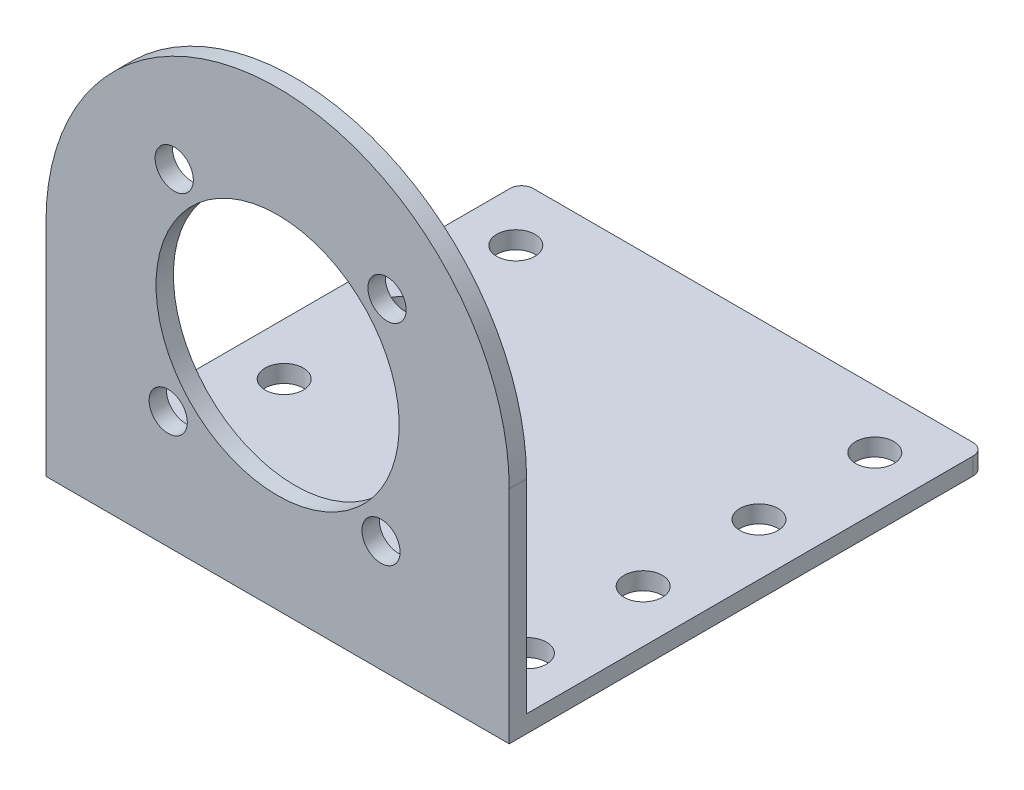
ISO-10303-21;
HEADER;
FILE_DESCRIPTION(('STEP AP214'),'2;1');
FILE_NAME('part.step','',(''),(''),'','','');
FILE_SCHEMA(('AUTOMOTIVE_DESIGN { 1 0 10303 214 1 1 1 1 }'));
ENDSEC;
DATA;
#1=APPLICATION_CONTEXT('core data for automotive mechanical design processes');
#2=APPLICATION_PROTOCOL_DEFINITION('international standard','automotive_design',2000,#1);
#3=PRODUCT_CONTEXT('',#1,'mechanical');
#4=PRODUCT('Part','Part','',(#3));
#5=PRODUCT_RELATED_PRODUCT_CATEGORY('part','',(#4));
#6=PRODUCT_DEFINITION_FORMATION('','',#4);
#7=PRODUCT_DEFINITION_CONTEXT('part definition',#1,'design');
#8=PRODUCT_DEFINITION('design','',#6,#7);
#9=PRODUCT_DEFINITION_SHAPE('','',#8);
#10=(LENGTH_UNIT() NAMED_UNIT(*) SI_UNIT(.MILLI.,.METRE.));
#11=(NAMED_UNIT(*) PLANE_ANGLE_UNIT() SI_UNIT($,.RADIAN.));
#12=(NAMED_UNIT(*) SI_UNIT($,.STERADIAN.) SOLID_ANGLE_UNIT());
#13=UNCERTAINTY_MEASURE_WITH_UNIT(LENGTH_MEASURE(1.E-05),#10,'distance_accuracy_value','');
#14=(GEOMETRIC_REPRESENTATION_CONTEXT(3) GLOBAL_UNCERTAINTY_ASSIGNED_CONTEXT((#13)) GLOBAL_UNIT_ASSIGNED_CONTEXT((#10,
#11,#12)) REPRESENTATION_CONTEXT('',''));
#15=CARTESIAN_POINT('',(0.,0.,0.));
#16=DIRECTION('',(0.,0.,1.));
#17=DIRECTION('',(1.,0.,0.));
#18=AXIS2_PLACEMENT_3D('',#15,#16,#17);
#19=CARTESIAN_POINT('',(40.,36.5355172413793,36.8894084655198));
#20=DIRECTION('',(0.,0.,-1.));
#21=DIRECTION('',(0.,1.,0.));
#22=AXIS2_PLACEMENT_3D('',#19,#20,#21);
#23=PLANE('',#22);
#24=CARTESIAN_POINT('',(29.4484356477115,25.4645185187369,36.8894084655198));
#25=DIRECTION('',(0.,0.,-1.));
#26=DIRECTION('',(0.,1.,0.));
#27=AXIS2_PLACEMENT_3D('',#24,#25,#26);
#28=CIRCLE('',#27,1.65000000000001);
#29=CARTESIAN_POINT('',(29.4484356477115,27.1145185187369,36.8894084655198));
#30=VERTEX_POINT('',#29);
#31=EDGE_CURVE('E642',#30,#30,#28,.T.);
#32=ORIENTED_EDGE('',*,*,#31,.T.);
#33=EDGE_LOOP('',(#32));
#34=FACE_BOUND('',#33,.T.);
#35=CARTESIAN_POINT('',(11.0709987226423,25.9839528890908,36.8894084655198));
#36=DIRECTION('',(0.,0.,-1.));
#37=DIRECTION('',(0.,1.,0.));
#38=AXIS2_PLACEMENT_3D('',#35,#36,#37);
#39=CIRCLE('',#38,1.65);
#40=CARTESIAN_POINT('',(11.0709987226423,27.6339528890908,36.8894084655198));
#41=VERTEX_POINT('',#40);
#42=EDGE_CURVE('E226',#41,#41,#39,.T.);
#43=ORIENTED_EDGE('',*,*,#42,.T.);
#44=EDGE_LOOP('',(#43));
#45=FACE_BOUND('',#44,.T.);
#46=CARTESIAN_POINT('',(10.5515643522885,7.6065159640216,36.8894084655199));
#47=DIRECTION('',(0.,0.,-1.));
#48=DIRECTION('',(0.,1.,0.));
#49=AXIS2_PLACEMENT_3D('',#46,#47,#48);
#50=CIRCLE('',#49,1.64999999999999);
#51=CARTESIAN_POINT('',(10.5515643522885,9.25651596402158,36.8894084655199));
#52=VERTEX_POINT('',#51);
#53=EDGE_CURVE('E298',#52,#52,#50,.T.);
#54=ORIENTED_EDGE('',*,*,#53,.T.);
#55=EDGE_LOOP('',(#54));
#56=FACE_BOUND('',#55,.T.);
#57=CARTESIAN_POINT('',(28.9290012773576,7.08708159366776,36.8894084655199));
#58=DIRECTION('',(0.,0.,-1.));
#59=DIRECTION('',(0.,1.,0.));
#60=AXIS2_PLACEMENT_3D('',#57,#58,#59);
#61=CIRCLE('',#60,1.64999999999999);
#62=CARTESIAN_POINT('',(28.9290012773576,8.73708159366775,36.8894084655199));
#63=VERTEX_POINT('',#62);
#64=EDGE_CURVE('E307',#63,#63,#61,.T.);
#65=ORIENTED_EDGE('',*,*,#64,.T.);
#66=EDGE_LOOP('',(#65));
#67=FACE_BOUND('',#66,.T.);
#68=CARTESIAN_POINT('',(20.,16.5355172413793,36.8894084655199));
#69=DIRECTION('',(0.,0.,-1.));
#70=DIRECTION('',(0.,1.,0.));
#71=AXIS2_PLACEMENT_3D('',#68,#69,#70);
#72=CIRCLE('',#71,10.5);
#73=CARTESIAN_POINT('',(20.,27.0355172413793,36.8894084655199));
#74=VERTEX_POINT('',#73);
#75=EDGE_CURVE('E313',#74,#74,#72,.T.);
#76=ORIENTED_EDGE('',*,*,#75,.T.);
#77=EDGE_LOOP('',(#76));
#78=FACE_BOUND('',#77,.T.);
#79=CARTESIAN_POINT('',(20.,16.5355172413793,36.8894084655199));
#80=DIRECTION('',(0.,0.,-1.));
#81=DIRECTION('',(0.,1.,0.));
#82=AXIS2_PLACEMENT_3D('',#79,#80,#81);
#83=CIRCLE('',#82,20.);
#84=CARTESIAN_POINT('',(40.,16.5355172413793,36.8894084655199));
#85=VERTEX_POINT('',#84);
#86=CARTESIAN_POINT('',(0.,16.5355172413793,36.8894084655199));
#87=VERTEX_POINT('',#86);
#88=EDGE_CURVE('E225',#85,#87,#83,.F.);
#89=ORIENTED_EDGE('',*,*,#88,.T.);
#90=DIRECTION('',(0.,-1.,0.));
#91=VECTOR('',#90,1.);
#92=CARTESIAN_POINT('',(0.,36.5355172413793,36.8894084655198));
#93=LINE('',#92,#91);
#94=CARTESIAN_POINT('',(0.,-2.53448275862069,36.8894084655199));
#95=VERTEX_POINT('',#94);
#96=EDGE_CURVE('E231',#87,#95,#93,.T.);
#97=ORIENTED_EDGE('',*,*,#96,.T.);
#98=DIRECTION('',(-1.,0.,0.));
#99=VECTOR('',#98,1.);
#100=CARTESIAN_POINT('',(40.,-2.53448275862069,36.8894084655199));
#101=LINE('',#100,#99);
#102=CARTESIAN_POINT('',(40.,-2.53448275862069,36.8894084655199));
#103=VERTEX_POINT('',#102);
#104=EDGE_CURVE('E246',#103,#95,#101,.T.);
#105=ORIENTED_EDGE('',*,*,#104,.F.);
#106=DIRECTION('',(0.,-1.,0.));
#107=VECTOR('',#106,1.);
#108=CARTESIAN_POINT('',(40.,36.5355172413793,36.8894084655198));
#109=LINE('',#108,#107);
#110=EDGE_CURVE('E238',#85,#103,#109,.T.);
#111=ORIENTED_EDGE('',*,*,#110,.F.);
#112=EDGE_LOOP('',(#89,#97,#105,#111));
#113=FACE_BOUND('',#112,.T.);
#114=ADVANCED_FACE('F146',(#34,#45,#56,#67,#78,#113),#23,.F.);
#115=CARTESIAN_POINT('',(40.,36.5355172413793,35.3894084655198));
#116=DIRECTION('',(0.,0.,-1.));
#117=DIRECTION('',(0.,1.,0.));
#118=AXIS2_PLACEMENT_3D('',#115,#116,#117);
#119=PLANE('',#118);
#120=CARTESIAN_POINT('',(29.4484356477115,25.4645185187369,35.3894084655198));
#121=DIRECTION('',(0.,0.,-1.));
#122=DIRECTION('',(0.,1.,0.));
#123=AXIS2_PLACEMENT_3D('',#120,#121,#122);
#124=CIRCLE('',#123,1.65000000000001);
#125=CARTESIAN_POINT('',(29.4484356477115,27.1145185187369,35.3894084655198));
#126=VERTEX_POINT('',#125);
#127=EDGE_CURVE('E640',#126,#126,#124,.T.);
#128=ORIENTED_EDGE('',*,*,#127,.F.);
#129=EDGE_LOOP('',(#128));
#130=FACE_BOUND('',#129,.T.);
#131=CARTESIAN_POINT('',(11.0709987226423,25.9839528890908,35.3894084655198));
#132=DIRECTION('',(0.,0.,-1.));
#133=DIRECTION('',(0.,1.,0.));
#134=AXIS2_PLACEMENT_3D('',#131,#132,#133);
#135=CIRCLE('',#134,1.65);
#136=CARTESIAN_POINT('',(11.0709987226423,27.6339528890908,35.3894084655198));
#137=VERTEX_POINT('',#136);
#138=EDGE_CURVE('E643',#137,#137,#135,.T.);
#139=ORIENTED_EDGE('',*,*,#138,.F.);
#140=EDGE_LOOP('',(#139));
#141=FACE_BOUND('',#140,.T.);
#142=CARTESIAN_POINT('',(10.5515643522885,7.6065159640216,35.3894084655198));
#143=DIRECTION('',(0.,0.,-1.));
#144=DIRECTION('',(0.,1.,0.));
#145=AXIS2_PLACEMENT_3D('',#142,#143,#144);
#146=CIRCLE('',#145,1.64999999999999);
#147=CARTESIAN_POINT('',(10.5515643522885,9.25651596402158,35.3894084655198));
#148=VERTEX_POINT('',#147);
#149=EDGE_CURVE('E295',#148,#148,#146,.T.);
#150=ORIENTED_EDGE('',*,*,#149,.F.);
#151=EDGE_LOOP('',(#150));
#152=FACE_BOUND('',#151,.T.);
#153=CARTESIAN_POINT('',(28.9290012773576,7.08708159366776,35.3894084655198));
#154=DIRECTION('',(0.,0.,-1.));
#155=DIRECTION('',(0.,1.,0.));
#156=AXIS2_PLACEMENT_3D('',#153,#154,#155);
#157=CIRCLE('',#156,1.64999999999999);
#158=CARTESIAN_POINT('',(28.9290012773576,8.73708159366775,35.3894084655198));
#159=VERTEX_POINT('',#158);
#160=EDGE_CURVE('E304',#159,#159,#157,.T.);
#161=ORIENTED_EDGE('',*,*,#160,.F.);
#162=EDGE_LOOP('',(#161));
#163=FACE_BOUND('',#162,.T.);
#164=CARTESIAN_POINT('',(20.,16.5355172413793,35.3894084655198));
#165=DIRECTION('',(0.,0.,-1.));
#166=DIRECTION('',(0.,1.,0.));
#167=AXIS2_PLACEMENT_3D('',#164,#165,#166);
#168=CIRCLE('',#167,10.5);
#169=CARTESIAN_POINT('',(20.,27.0355172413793,35.3894084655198));
#170=VERTEX_POINT('',#169);
#171=EDGE_CURVE('E310',#170,#170,#168,.T.);
#172=ORIENTED_EDGE('',*,*,#171,.F.);
#173=EDGE_LOOP('',(#172));
#174=FACE_BOUND('',#173,.T.);
#175=DIRECTION('',(0.,-1.,0.));
#176=VECTOR('',#175,1.);
#177=CARTESIAN_POINT('',(0.,36.5355172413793,35.3894084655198));
#178=LINE('',#177,#176);
#179=CARTESIAN_POINT('',(0.,16.5355172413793,35.3894084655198));
#180=VERTEX_POINT('',#179);
#181=CARTESIAN_POINT('',(0.,-1.03448275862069,35.3894084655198));
#182=VERTEX_POINT('',#181);
#183=EDGE_CURVE('E229',#180,#182,#178,.T.);
#184=ORIENTED_EDGE('',*,*,#183,.F.);
#185=CARTESIAN_POINT('',(20.,16.5355172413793,35.3894084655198));
#186=DIRECTION('',(0.,0.,-1.));
#187=DIRECTION('',(0.,1.,0.));
#188=AXIS2_PLACEMENT_3D('',#185,#186,#187);
#189=CIRCLE('',#188,20.);
#190=CARTESIAN_POINT('',(40.,16.5355172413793,35.3894084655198));
#191=VERTEX_POINT('',#190);
#192=EDGE_CURVE('E215',#191,#180,#189,.F.);
#193=ORIENTED_EDGE('',*,*,#192,.F.);
#194=DIRECTION('',(0.,-1.,0.));
#195=VECTOR('',#194,1.);
#196=CARTESIAN_POINT('',(40.,36.5355172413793,35.3894084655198));
#197=LINE('',#196,#195);
#198=CARTESIAN_POINT('',(40.,-1.03448275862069,35.3894084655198));
#199=VERTEX_POINT('',#198);
#200=EDGE_CURVE('E249',#191,#199,#197,.T.);
#201=ORIENTED_EDGE('',*,*,#200,.T.);
#202=DIRECTION('',(1.,0.,0.));
#203=VECTOR('',#202,1.);
#204=CARTESIAN_POINT('',(40.,-1.03448275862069,35.3894084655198));
#205=LINE('',#204,#203);
#206=EDGE_CURVE('E236',#182,#199,#205,.T.);
#207=ORIENTED_EDGE('',*,*,#206,.F.);
#208=EDGE_LOOP('',(#184,#193,#201,#207));
#209=FACE_BOUND('',#208,.T.);
#210=ADVANCED_FACE('F234',(#130,#141,#152,#163,#174,#209),#119,.T.);
#211=CARTESIAN_POINT('',(0.,0.,0.));
#212=DIRECTION('',(1.,0.,0.));
#213=DIRECTION('',(0.,0.,-1.));
#214=AXIS2_PLACEMENT_3D('',#211,#212,#213);
#215=PLANE('',#214);
#216=DIRECTION('',(0.,0.,-1.));
#217=VECTOR('',#216,1.);
#218=CARTESIAN_POINT('',(0.,-1.03448275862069,36.8894084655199));
#219=LINE('',#218,#217);
#220=CARTESIAN_POINT('',(0.,-1.03448275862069,-3.17959153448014));
#221=VERTEX_POINT('',#220);
#222=EDGE_CURVE('E254',#182,#221,#219,.T.);
#223=ORIENTED_EDGE('',*,*,#222,.T.);
#224=DIRECTION('',(0.,1.,0.));
#225=VECTOR('',#224,1.);
#226=CARTESIAN_POINT('',(0.,0.,-3.17959153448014));
#227=LINE('',#226,#225);
#228=CARTESIAN_POINT('',(0.,-2.53448275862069,-3.17959153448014));
#229=VERTEX_POINT('',#228);
#230=EDGE_CURVE('E169',#221,#229,#227,.F.);
#231=ORIENTED_EDGE('',*,*,#230,.T.);
#232=DIRECTION('',(0.,0.,-1.));
#233=VECTOR('',#232,1.);
#234=CARTESIAN_POINT('',(0.,-2.53448275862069,36.8894084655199));
#235=LINE('',#234,#233);
#236=EDGE_CURVE('E239',#95,#229,#235,.T.);
#237=ORIENTED_EDGE('',*,*,#236,.F.);
#238=ORIENTED_EDGE('',*,*,#96,.F.);
#239=DIRECTION('',(0.,0.,-1.));
#240=VECTOR('',#239,1.);
#241=CARTESIAN_POINT('',(0.,16.5355172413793,75.3894084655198));
#242=LINE('',#241,#240);
#243=EDGE_CURVE('E218',#180,#87,#242,.F.);
#244=ORIENTED_EDGE('',*,*,#243,.F.);
#245=ORIENTED_EDGE('',*,*,#183,.T.);
#246=EDGE_LOOP('',(#223,#231,#237,#238,#244,#245));
#247=FACE_BOUND('',#246,.T.);
#248=ADVANCED_FACE('F228',(#247),#215,.F.);
#249=CARTESIAN_POINT('',(40.,0.,0.));
#250=DIRECTION('',(1.,0.,0.));
#251=DIRECTION('',(0.,0.,-1.));
#252=AXIS2_PLACEMENT_3D('',#249,#250,#251);
#253=PLANE('',#252);
#254=DIRECTION('',(0.,0.,-1.));
#255=VECTOR('',#254,1.);
#256=CARTESIAN_POINT('',(40.,-2.53448275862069,36.8894084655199));
#257=LINE('',#256,#255);
#258=CARTESIAN_POINT('',(40.,-2.53448275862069,-3.17959153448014));
#259=VERTEX_POINT('',#258);
#260=EDGE_CURVE('E241',#103,#259,#257,.T.);
#261=ORIENTED_EDGE('',*,*,#260,.T.);
#262=DIRECTION('',(0.,1.,0.));
#263=VECTOR('',#262,1.);
#264=CARTESIAN_POINT('',(40.,-1.03448275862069,-3.17959153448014));
#265=LINE('',#264,#263);
#266=CARTESIAN_POINT('',(40.,-1.03448275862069,-3.17959153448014));
#267=VERTEX_POINT('',#266);
#268=EDGE_CURVE('E12',#259,#267,#265,.T.);
#269=ORIENTED_EDGE('',*,*,#268,.T.);
#270=DIRECTION('',(0.,0.,-1.));
#271=VECTOR('',#270,1.);
#272=CARTESIAN_POINT('',(40.,-1.03448275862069,36.8894084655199));
#273=LINE('',#272,#271);
#274=EDGE_CURVE('E250',#199,#267,#273,.T.);
#275=ORIENTED_EDGE('',*,*,#274,.F.);
#276=ORIENTED_EDGE('',*,*,#200,.F.);
#277=DIRECTION('',(0.,0.,-1.));
#278=VECTOR('',#277,1.);
#279=CARTESIAN_POINT('',(40.,16.5355172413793,75.3894084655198));
#280=LINE('',#279,#278);
#281=EDGE_CURVE('E221',#191,#85,#280,.F.);
#282=ORIENTED_EDGE('',*,*,#281,.T.);
#283=ORIENTED_EDGE('',*,*,#110,.T.);
#284=EDGE_LOOP('',(#261,#269,#275,#276,#282,#283));
#285=FACE_BOUND('',#284,.T.);
#286=ADVANCED_FACE('F288',(#285),#253,.T.);
#287=CARTESIAN_POINT('',(40.,-2.53448275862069,36.8894084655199));
#288=DIRECTION('',(0.,1.,0.));
#289=DIRECTION('',(0.,0.,1.));
#290=AXIS2_PLACEMENT_3D('',#287,#288,#289);
#291=PLANE('',#290);
#292=CARTESIAN_POINT('',(35.5,-2.53448275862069,0.820408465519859));
#293=DIRECTION('',(0.,1.,0.));
#294=DIRECTION('',(0.,0.,1.));
#295=AXIS2_PLACEMENT_3D('',#292,#293,#294);
#296=CIRCLE('',#295,1.65);
#297=CARTESIAN_POINT('',(35.5,-2.53448275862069,2.47040846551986));
#298=VERTEX_POINT('',#297);
#299=EDGE_CURVE('E319',#298,#298,#296,.T.);
#300=ORIENTED_EDGE('',*,*,#299,.T.);
#301=EDGE_LOOP('',(#300));
#302=FACE_BOUND('',#301,.T.);
#303=CARTESIAN_POINT('',(35.5,-2.53448275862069,10.8204084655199));
#304=DIRECTION('',(0.,1.,0.));
#305=DIRECTION('',(0.,0.,1.));
#306=AXIS2_PLACEMENT_3D('',#303,#304,#305);
#307=CIRCLE('',#306,1.65);
#308=CARTESIAN_POINT('',(35.5,-2.53448275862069,12.4704084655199));
#309=VERTEX_POINT('',#308);
#310=EDGE_CURVE('E325',#309,#309,#307,.T.);
#311=ORIENTED_EDGE('',*,*,#310,.T.);
#312=EDGE_LOOP('',(#311));
#313=FACE_BOUND('',#312,.T.);
#314=CARTESIAN_POINT('',(35.5,-2.53448275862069,20.8204084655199));
#315=DIRECTION('',(0.,1.,0.));
#316=DIRECTION('',(0.,0.,1.));
#317=AXIS2_PLACEMENT_3D('',#314,#315,#316);
#318=CIRCLE('',#317,1.65);
#319=CARTESIAN_POINT('',(35.5,-2.53448275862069,22.4704084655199));
#320=VERTEX_POINT('',#319);
#321=EDGE_CURVE('E331',#320,#320,#318,.T.);
#322=ORIENTED_EDGE('',*,*,#321,.T.);
#323=EDGE_LOOP('',(#322));
#324=FACE_BOUND('',#323,.T.);
#325=CARTESIAN_POINT('',(35.5,-2.53448275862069,30.8204084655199));
#326=DIRECTION('',(0.,1.,0.));
#327=DIRECTION('',(0.,0.,1.));
#328=AXIS2_PLACEMENT_3D('',#325,#326,#327);
#329=CIRCLE('',#328,1.65);
#330=CARTESIAN_POINT('',(35.5,-2.53448275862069,32.4704084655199));
#331=VERTEX_POINT('',#330);
#332=EDGE_CURVE('E337',#331,#331,#329,.T.);
#333=ORIENTED_EDGE('',*,*,#332,.T.);
#334=EDGE_LOOP('',(#333));
#335=FACE_BOUND('',#334,.T.);
#336=CARTESIAN_POINT('',(4.5,-2.53448275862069,0.820408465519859));
#337=DIRECTION('',(0.,1.,0.));
#338=DIRECTION('',(0.,0.,1.));
#339=AXIS2_PLACEMENT_3D('',#336,#337,#338);
#340=CIRCLE('',#339,1.65);
#341=CARTESIAN_POINT('',(4.5,-2.53448275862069,2.47040846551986));
#342=VERTEX_POINT('',#341);
#343=EDGE_CURVE('E343',#342,#342,#340,.T.);
#344=ORIENTED_EDGE('',*,*,#343,.T.);
#345=EDGE_LOOP('',(#344));
#346=FACE_BOUND('',#345,.T.);
#347=CARTESIAN_POINT('',(4.5,-2.53448275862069,10.8204084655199));
#348=DIRECTION('',(0.,1.,0.));
#349=DIRECTION('',(0.,0.,1.));
#350=AXIS2_PLACEMENT_3D('',#347,#348,#349);
#351=CIRCLE('',#350,1.65);
#352=CARTESIAN_POINT('',(4.5,-2.53448275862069,12.4704084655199));
#353=VERTEX_POINT('',#352);
#354=EDGE_CURVE('E349',#353,#353,#351,.T.);
#355=ORIENTED_EDGE('',*,*,#354,.T.);
#356=EDGE_LOOP('',(#355));
#357=FACE_BOUND('',#356,.T.);
#358=CARTESIAN_POINT('',(4.5,-2.53448275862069,20.8204084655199));
#359=DIRECTION('',(0.,1.,0.));
#360=DIRECTION('',(0.,0.,1.));
#361=AXIS2_PLACEMENT_3D('',#358,#359,#360);
#362=CIRCLE('',#361,1.65);
#363=CARTESIAN_POINT('',(4.5,-2.53448275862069,22.4704084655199));
#364=VERTEX_POINT('',#363);
#365=EDGE_CURVE('E355',#364,#364,#362,.T.);
#366=ORIENTED_EDGE('',*,*,#365,.T.);
#367=EDGE_LOOP('',(#366));
#368=FACE_BOUND('',#367,.T.);
#369=CARTESIAN_POINT('',(4.5,-2.53448275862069,30.8204084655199));
#370=DIRECTION('',(0.,1.,0.));
#371=DIRECTION('',(0.,0.,1.));
#372=AXIS2_PLACEMENT_3D('',#369,#370,#371);
#373=CIRCLE('',#372,1.65);
#374=CARTESIAN_POINT('',(4.5,-2.53448275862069,32.4704084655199));
#375=VERTEX_POINT('',#374);
#376=EDGE_CURVE('E256',#375,#375,#373,.T.);
#377=ORIENTED_EDGE('',*,*,#376,.T.);
#378=EDGE_LOOP('',(#377));
#379=FACE_BOUND('',#378,.T.);
#380=ORIENTED_EDGE('',*,*,#236,.T.);
#381=CARTESIAN_POINT('',(1.,-2.53448275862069,-3.17959153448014));
#382=DIRECTION('',(0.,1.,0.));
#383=DIRECTION('',(0.,0.,1.));
#384=AXIS2_PLACEMENT_3D('',#381,#382,#383);
#385=CIRCLE('',#384,1.);
#386=CARTESIAN_POINT('',(1.,-2.53448275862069,-4.17959153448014));
#387=VERTEX_POINT('',#386);
#388=EDGE_CURVE('E154',#229,#387,#385,.F.);
#389=ORIENTED_EDGE('',*,*,#388,.T.);
#390=DIRECTION('',(-1.,0.,0.));
#391=VECTOR('',#390,1.);
#392=CARTESIAN_POINT('',(40.,-2.53448275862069,-4.17959153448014));
#393=LINE('',#392,#391);
#394=CARTESIAN_POINT('',(39.,-2.53448275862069,-4.17959153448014));
#395=VERTEX_POINT('',#394);
#396=EDGE_CURVE('E257',#395,#387,#393,.T.);
#397=ORIENTED_EDGE('',*,*,#396,.F.);
#398=CARTESIAN_POINT('',(39.,-2.53448275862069,-3.17959153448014));
#399=DIRECTION('',(0.,1.,0.));
#400=DIRECTION('',(0.,0.,1.));
#401=AXIS2_PLACEMENT_3D('',#398,#399,#400);
#402=CIRCLE('',#401,1.);
#403=EDGE_CURVE('E161',#395,#259,#402,.F.);
#404=ORIENTED_EDGE('',*,*,#403,.T.);
#405=ORIENTED_EDGE('',*,*,#260,.F.);
#406=ORIENTED_EDGE('',*,*,#104,.T.);
#407=EDGE_LOOP('',(#380,#389,#397,#404,#405,#406));
#408=FACE_BOUND('',#407,.T.);
#409=ADVANCED_FACE('F274',(#302,#313,#324,#335,#346,#357,#368,#379,#408),#291,.F.);
#410=CARTESIAN_POINT('',(40.,-2.53448275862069,-4.17959153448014));
#411=DIRECTION('',(0.,0.,1.));
#412=DIRECTION('',(1.,0.,0.));
#413=AXIS2_PLACEMENT_3D('',#410,#411,#412);
#414=PLANE('',#413);
#415=ORIENTED_EDGE('',*,*,#396,.T.);
#416=DIRECTION('',(0.,1.,0.));
#417=VECTOR('',#416,1.);
#418=CARTESIAN_POINT('',(1.,-2.53448275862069,-4.17959153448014));
#419=LINE('',#418,#417);
#420=CARTESIAN_POINT('',(1.,-1.03448275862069,-4.17959153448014));
#421=VERTEX_POINT('',#420);
#422=EDGE_CURVE('E265',#387,#421,#419,.T.);
#423=ORIENTED_EDGE('',*,*,#422,.T.);
#424=DIRECTION('',(-1.,0.,0.));
#425=VECTOR('',#424,1.);
#426=CARTESIAN_POINT('',(40.,-1.03448275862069,-4.17959153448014));
#427=LINE('',#426,#425);
#428=CARTESIAN_POINT('',(39.,-1.03448275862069,-4.17959153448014));
#429=VERTEX_POINT('',#428);
#430=EDGE_CURVE('E253',#429,#421,#427,.T.);
#431=ORIENTED_EDGE('',*,*,#430,.F.);
#432=DIRECTION('',(0.,1.,0.));
#433=VECTOR('',#432,1.);
#434=CARTESIAN_POINT('',(39.,-2.53448275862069,-4.17959153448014));
#435=LINE('',#434,#433);
#436=EDGE_CURVE('E232',#429,#395,#435,.F.);
#437=ORIENTED_EDGE('',*,*,#436,.T.);
#438=EDGE_LOOP('',(#415,#423,#431,#437));
#439=FACE_BOUND('',#438,.T.);
#440=ADVANCED_FACE('F278',(#439),#414,.F.);
#441=CARTESIAN_POINT('',(40.,-1.03448275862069,36.8894084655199));
#442=DIRECTION('',(0.,1.,0.));
#443=DIRECTION('',(0.,0.,1.));
#444=AXIS2_PLACEMENT_3D('',#441,#442,#443);
#445=PLANE('',#444);
#446=CARTESIAN_POINT('',(35.5,-1.03448275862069,0.820408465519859));
#447=DIRECTION('',(0.,1.,0.));
#448=DIRECTION('',(0.,0.,1.));
#449=AXIS2_PLACEMENT_3D('',#446,#447,#448);
#450=CIRCLE('',#449,1.65);
#451=CARTESIAN_POINT('',(35.5,-1.03448275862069,2.47040846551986));
#452=VERTEX_POINT('',#451);
#453=EDGE_CURVE('E316',#452,#452,#450,.T.);
#454=ORIENTED_EDGE('',*,*,#453,.F.);
#455=EDGE_LOOP('',(#454));
#456=FACE_BOUND('',#455,.T.);
#457=CARTESIAN_POINT('',(35.5,-1.03448275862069,10.8204084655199));
#458=DIRECTION('',(0.,1.,0.));
#459=DIRECTION('',(0.,0.,1.));
#460=AXIS2_PLACEMENT_3D('',#457,#458,#459);
#461=CIRCLE('',#460,1.65);
#462=CARTESIAN_POINT('',(35.5,-1.03448275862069,12.4704084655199));
#463=VERTEX_POINT('',#462);
#464=EDGE_CURVE('E322',#463,#463,#461,.T.);
#465=ORIENTED_EDGE('',*,*,#464,.F.);
#466=EDGE_LOOP('',(#465));
#467=FACE_BOUND('',#466,.T.);
#468=CARTESIAN_POINT('',(35.5,-1.03448275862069,20.8204084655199));
#469=DIRECTION('',(0.,1.,0.));
#470=DIRECTION('',(0.,0.,1.));
#471=AXIS2_PLACEMENT_3D('',#468,#469,#470);
#472=CIRCLE('',#471,1.65);
#473=CARTESIAN_POINT('',(35.5,-1.03448275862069,22.4704084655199));
#474=VERTEX_POINT('',#473);
#475=EDGE_CURVE('E328',#474,#474,#472,.T.);
#476=ORIENTED_EDGE('',*,*,#475,.F.);
#477=EDGE_LOOP('',(#476));
#478=FACE_BOUND('',#477,.T.);
#479=CARTESIAN_POINT('',(35.5,-1.03448275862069,30.8204084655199));
#480=DIRECTION('',(0.,1.,0.));
#481=DIRECTION('',(0.,0.,1.));
#482=AXIS2_PLACEMENT_3D('',#479,#480,#481);
#483=CIRCLE('',#482,1.65);
#484=CARTESIAN_POINT('',(35.5,-1.03448275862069,32.4704084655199));
#485=VERTEX_POINT('',#484);
#486=EDGE_CURVE('E334',#485,#485,#483,.T.);
#487=ORIENTED_EDGE('',*,*,#486,.F.);
#488=EDGE_LOOP('',(#487));
#489=FACE_BOUND('',#488,.T.);
#490=CARTESIAN_POINT('',(4.5,-1.03448275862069,0.820408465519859));
#491=DIRECTION('',(0.,1.,0.));
#492=DIRECTION('',(0.,0.,1.));
#493=AXIS2_PLACEMENT_3D('',#490,#491,#492);
#494=CIRCLE('',#493,1.65);
#495=CARTESIAN_POINT('',(4.5,-1.03448275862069,2.47040846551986));
#496=VERTEX_POINT('',#495);
#497=EDGE_CURVE('E340',#496,#496,#494,.T.);
#498=ORIENTED_EDGE('',*,*,#497,.F.);
#499=EDGE_LOOP('',(#498));
#500=FACE_BOUND('',#499,.T.);
#501=CARTESIAN_POINT('',(4.5,-1.03448275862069,10.8204084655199));
#502=DIRECTION('',(0.,1.,0.));
#503=DIRECTION('',(0.,0.,1.));
#504=AXIS2_PLACEMENT_3D('',#501,#502,#503);
#505=CIRCLE('',#504,1.65);
#506=CARTESIAN_POINT('',(4.5,-1.03448275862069,12.4704084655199));
#507=VERTEX_POINT('',#506);
#508=EDGE_CURVE('E346',#507,#507,#505,.T.);
#509=ORIENTED_EDGE('',*,*,#508,.F.);
#510=EDGE_LOOP('',(#509));
#511=FACE_BOUND('',#510,.T.);
#512=CARTESIAN_POINT('',(4.5,-1.03448275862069,20.8204084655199));
#513=DIRECTION('',(0.,1.,0.));
#514=DIRECTION('',(0.,0.,1.));
#515=AXIS2_PLACEMENT_3D('',#512,#513,#514);
#516=CIRCLE('',#515,1.65);
#517=CARTESIAN_POINT('',(4.5,-1.03448275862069,22.4704084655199));
#518=VERTEX_POINT('',#517);
#519=EDGE_CURVE('E352',#518,#518,#516,.T.);
#520=ORIENTED_EDGE('',*,*,#519,.F.);
#521=EDGE_LOOP('',(#520));
#522=FACE_BOUND('',#521,.T.);
#523=CARTESIAN_POINT('',(4.5,-1.03448275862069,30.8204084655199));
#524=DIRECTION('',(0.,1.,0.));
#525=DIRECTION('',(0.,0.,1.));
#526=AXIS2_PLACEMENT_3D('',#523,#524,#525);
#527=CIRCLE('',#526,1.65);
#528=CARTESIAN_POINT('',(4.5,-1.03448275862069,32.4704084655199));
#529=VERTEX_POINT('',#528);
#530=EDGE_CURVE('E358',#529,#529,#527,.T.);
#531=ORIENTED_EDGE('',*,*,#530,.F.);
#532=EDGE_LOOP('',(#531));
#533=FACE_BOUND('',#532,.T.);
#534=ORIENTED_EDGE('',*,*,#430,.T.);
#535=CARTESIAN_POINT('',(1.,-1.03448275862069,-3.17959153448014));
#536=DIRECTION('',(0.,1.,0.));
#537=DIRECTION('',(0.,0.,1.));
#538=AXIS2_PLACEMENT_3D('',#535,#536,#537);
#539=CIRCLE('',#538,1.);
#540=EDGE_CURVE('E270',#421,#221,#539,.T.);
#541=ORIENTED_EDGE('',*,*,#540,.T.);
#542=ORIENTED_EDGE('',*,*,#222,.F.);
#543=ORIENTED_EDGE('',*,*,#206,.T.);
#544=ORIENTED_EDGE('',*,*,#274,.T.);
#545=CARTESIAN_POINT('',(39.,-1.03448275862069,-3.17959153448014));
#546=DIRECTION('',(0.,1.,0.));
#547=DIRECTION('',(0.,0.,1.));
#548=AXIS2_PLACEMENT_3D('',#545,#546,#547);
#549=CIRCLE('',#548,1.);
#550=EDGE_CURVE('E268',#267,#429,#549,.T.);
#551=ORIENTED_EDGE('',*,*,#550,.T.);
#552=EDGE_LOOP('',(#534,#541,#542,#543,#544,#551));
#553=FACE_BOUND('',#552,.T.);
#554=ADVANCED_FACE('F283',(#456,#467,#478,#489,#500,#511,#522,#533,#553),#445,.T.);
#555=CARTESIAN_POINT('',(4.5,-41.0344827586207,30.8204084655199));
#556=DIRECTION('',(0.,1.,0.));
#557=DIRECTION('',(0.,0.,1.));
#558=AXIS2_PLACEMENT_3D('',#555,#556,#557);
#559=CYLINDRICAL_SURFACE('',#558,1.65);
#560=ORIENTED_EDGE('',*,*,#530,.T.);
#561=EDGE_LOOP('',(#560));
#562=FACE_BOUND('',#561,.T.);
#563=ORIENTED_EDGE('',*,*,#376,.F.);
#564=EDGE_LOOP('',(#563));
#565=FACE_BOUND('',#564,.T.);
#566=ADVANCED_FACE('F364',(#562,#565),#559,.F.);
#567=CARTESIAN_POINT('',(4.5,-41.0344827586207,20.8204084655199));
#568=DIRECTION('',(0.,1.,0.));
#569=DIRECTION('',(0.,0.,1.));
#570=AXIS2_PLACEMENT_3D('',#567,#568,#569);
#571=CYLINDRICAL_SURFACE('',#570,1.65);
#572=ORIENTED_EDGE('',*,*,#519,.T.);
#573=EDGE_LOOP('',(#572));
#574=FACE_BOUND('',#573,.T.);
#575=ORIENTED_EDGE('',*,*,#365,.F.);
#576=EDGE_LOOP('',(#575));
#577=FACE_BOUND('',#576,.T.);
#578=ADVANCED_FACE('F366',(#574,#577),#571,.F.);
#579=CARTESIAN_POINT('',(4.5,-41.0344827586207,10.8204084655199));
#580=DIRECTION('',(0.,1.,0.));
#581=DIRECTION('',(0.,0.,1.));
#582=AXIS2_PLACEMENT_3D('',#579,#580,#581);
#583=CYLINDRICAL_SURFACE('',#582,1.65);
#584=ORIENTED_EDGE('',*,*,#508,.T.);
#585=EDGE_LOOP('',(#584));
#586=FACE_BOUND('',#585,.T.);
#587=ORIENTED_EDGE('',*,*,#354,.F.);
#588=EDGE_LOOP('',(#587));
#589=FACE_BOUND('',#588,.T.);
#590=ADVANCED_FACE('F373',(#586,#589),#583,.F.);
#591=CARTESIAN_POINT('',(4.5,-41.0344827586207,0.820408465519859));
#592=DIRECTION('',(0.,1.,0.));
#593=DIRECTION('',(0.,0.,1.));
#594=AXIS2_PLACEMENT_3D('',#591,#592,#593);
#595=CYLINDRICAL_SURFACE('',#594,1.65);
#596=ORIENTED_EDGE('',*,*,#497,.T.);
#597=EDGE_LOOP('',(#596));
#598=FACE_BOUND('',#597,.T.);
#599=ORIENTED_EDGE('',*,*,#343,.F.);
#600=EDGE_LOOP('',(#599));
#601=FACE_BOUND('',#600,.T.);
#602=ADVANCED_FACE('F438',(#598,#601),#595,.F.);
#603=CARTESIAN_POINT('',(35.5,-41.0344827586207,30.8204084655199));
#604=DIRECTION('',(0.,1.,0.));
#605=DIRECTION('',(0.,0.,1.));
#606=AXIS2_PLACEMENT_3D('',#603,#604,#605);
#607=CYLINDRICAL_SURFACE('',#606,1.65);
#608=ORIENTED_EDGE('',*,*,#486,.T.);
#609=EDGE_LOOP('',(#608));
#610=FACE_BOUND('',#609,.T.);
#611=ORIENTED_EDGE('',*,*,#332,.F.);
#612=EDGE_LOOP('',(#611));
#613=FACE_BOUND('',#612,.T.);
#614=ADVANCED_FACE('F434',(#610,#613),#607,.F.);
#615=CARTESIAN_POINT('',(35.5,-41.0344827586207,20.8204084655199));
#616=DIRECTION('',(0.,1.,0.));
#617=DIRECTION('',(0.,0.,1.));
#618=AXIS2_PLACEMENT_3D('',#615,#616,#617);
#619=CYLINDRICAL_SURFACE('',#618,1.65);
#620=ORIENTED_EDGE('',*,*,#475,.T.);
#621=EDGE_LOOP('',(#620));
#622=FACE_BOUND('',#621,.T.);
#623=ORIENTED_EDGE('',*,*,#321,.F.);
#624=EDGE_LOOP('',(#623));
#625=FACE_BOUND('',#624,.T.);
#626=ADVANCED_FACE('F430',(#622,#625),#619,.F.);
#627=CARTESIAN_POINT('',(35.5,-41.0344827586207,10.8204084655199));
#628=DIRECTION('',(0.,1.,0.));
#629=DIRECTION('',(0.,0.,1.));
#630=AXIS2_PLACEMENT_3D('',#627,#628,#629);
#631=CYLINDRICAL_SURFACE('',#630,1.65);
#632=ORIENTED_EDGE('',*,*,#464,.T.);
#633=EDGE_LOOP('',(#632));
#634=FACE_BOUND('',#633,.T.);
#635=ORIENTED_EDGE('',*,*,#310,.F.);
#636=EDGE_LOOP('',(#635));
#637=FACE_BOUND('',#636,.T.);
#638=ADVANCED_FACE('F426',(#634,#637),#631,.F.);
#639=CARTESIAN_POINT('',(35.5,-41.0344827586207,0.820408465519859));
#640=DIRECTION('',(0.,1.,0.));
#641=DIRECTION('',(0.,0.,1.));
#642=AXIS2_PLACEMENT_3D('',#639,#640,#641);
#643=CYLINDRICAL_SURFACE('',#642,1.65);
#644=ORIENTED_EDGE('',*,*,#453,.T.);
#645=EDGE_LOOP('',(#644));
#646=FACE_BOUND('',#645,.T.);
#647=ORIENTED_EDGE('',*,*,#299,.F.);
#648=EDGE_LOOP('',(#647));
#649=FACE_BOUND('',#648,.T.);
#650=ADVANCED_FACE('F422',(#646,#649),#643,.F.);
#651=CARTESIAN_POINT('',(20.,16.5355172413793,75.3894084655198));
#652=DIRECTION('',(0.,0.,-1.));
#653=DIRECTION('',(0.,1.,0.));
#654=AXIS2_PLACEMENT_3D('',#651,#652,#653);
#655=CYLINDRICAL_SURFACE('',#654,10.5);
#656=ORIENTED_EDGE('',*,*,#171,.T.);
#657=EDGE_LOOP('',(#656));
#658=FACE_BOUND('',#657,.T.);
#659=ORIENTED_EDGE('',*,*,#75,.F.);
#660=EDGE_LOOP('',(#659));
#661=FACE_BOUND('',#660,.T.);
#662=ADVANCED_FACE('F418',(#658,#661),#655,.F.);
#663=CARTESIAN_POINT('',(28.9290012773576,7.08708159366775,75.3894084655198));
#664=DIRECTION('',(0.,0.,-1.));
#665=DIRECTION('',(0.,1.,0.));
#666=AXIS2_PLACEMENT_3D('',#663,#664,#665);
#667=CYLINDRICAL_SURFACE('',#666,1.64999999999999);
#668=ORIENTED_EDGE('',*,*,#160,.T.);
#669=EDGE_LOOP('',(#668));
#670=FACE_BOUND('',#669,.T.);
#671=ORIENTED_EDGE('',*,*,#64,.F.);
#672=EDGE_LOOP('',(#671));
#673=FACE_BOUND('',#672,.T.);
#674=ADVANCED_FACE('F414',(#670,#673),#667,.F.);
#675=CARTESIAN_POINT('',(10.5515643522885,7.60651596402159,75.3894084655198));
#676=DIRECTION('',(0.,0.,-1.));
#677=DIRECTION('',(0.,1.,0.));
#678=AXIS2_PLACEMENT_3D('',#675,#676,#677);
#679=CYLINDRICAL_SURFACE('',#678,1.64999999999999);
#680=ORIENTED_EDGE('',*,*,#149,.T.);
#681=EDGE_LOOP('',(#680));
#682=FACE_BOUND('',#681,.T.);
#683=ORIENTED_EDGE('',*,*,#53,.F.);
#684=EDGE_LOOP('',(#683));
#685=FACE_BOUND('',#684,.T.);
#686=ADVANCED_FACE('F411',(#682,#685),#679,.F.);
#687=CARTESIAN_POINT('',(20.,16.5355172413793,75.3894084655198));
#688=DIRECTION('',(0.,0.,-1.));
#689=DIRECTION('',(0.,1.,0.));
#690=AXIS2_PLACEMENT_3D('',#687,#688,#689);
#691=CYLINDRICAL_SURFACE('',#690,20.);
#692=ORIENTED_EDGE('',*,*,#281,.F.);
#693=ORIENTED_EDGE('',*,*,#192,.T.);
#694=ORIENTED_EDGE('',*,*,#243,.T.);
#695=ORIENTED_EDGE('',*,*,#88,.F.);
#696=EDGE_LOOP('',(#692,#693,#694,#695));
#697=FACE_BOUND('',#696,.T.);
#698=ADVANCED_FACE('F217',(#697),#691,.T.);
#699=CARTESIAN_POINT('',(11.0709987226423,25.9839528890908,75.3894084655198));
#700=DIRECTION('',(0.,0.,-1.));
#701=DIRECTION('',(0.,1.,0.));
#702=AXIS2_PLACEMENT_3D('',#699,#700,#701);
#703=CYLINDRICAL_SURFACE('',#702,1.65);
#704=ORIENTED_EDGE('',*,*,#138,.T.);
#705=EDGE_LOOP('',(#704));
#706=FACE_BOUND('',#705,.T.);
#707=ORIENTED_EDGE('',*,*,#42,.F.);
#708=EDGE_LOOP('',(#707));
#709=FACE_BOUND('',#708,.T.);
#710=ADVANCED_FACE('F398',(#706,#709),#703,.F.);
#711=CARTESIAN_POINT('',(29.4484356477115,25.4645185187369,75.3894084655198));
#712=DIRECTION('',(0.,0.,-1.));
#713=DIRECTION('',(0.,1.,0.));
#714=AXIS2_PLACEMENT_3D('',#711,#712,#713);
#715=CYLINDRICAL_SURFACE('',#714,1.65000000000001);
#716=ORIENTED_EDGE('',*,*,#127,.T.);
#717=EDGE_LOOP('',(#716));
#718=FACE_BOUND('',#717,.T.);
#719=ORIENTED_EDGE('',*,*,#31,.F.);
#720=EDGE_LOOP('',(#719));
#721=FACE_BOUND('',#720,.T.);
#722=ADVANCED_FACE('F393',(#718,#721),#715,.F.);
#723=CARTESIAN_POINT('',(1.,-2.53448275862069,-3.17959153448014));
#724=DIRECTION('',(0.,1.,0.));
#725=DIRECTION('',(0.,0.,1.));
#726=AXIS2_PLACEMENT_3D('',#723,#724,#725);
#727=CYLINDRICAL_SURFACE('',#726,1.);
#728=ORIENTED_EDGE('',*,*,#388,.F.);
#729=ORIENTED_EDGE('',*,*,#230,.F.);
#730=ORIENTED_EDGE('',*,*,#540,.F.);
#731=ORIENTED_EDGE('',*,*,#422,.F.);
#732=EDGE_LOOP('',(#728,#729,#730,#731));
#733=FACE_BOUND('',#732,.T.);
#734=ADVANCED_FACE('F281',(#733),#727,.T.);
#735=CARTESIAN_POINT('',(39.,0.,-3.17959153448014));
#736=DIRECTION('',(0.,-1.,0.));
#737=DIRECTION('',(0.,0.,-1.));
#738=AXIS2_PLACEMENT_3D('',#735,#736,#737);
#739=CYLINDRICAL_SURFACE('',#738,1.);
#740=ORIENTED_EDGE('',*,*,#403,.F.);
#741=ORIENTED_EDGE('',*,*,#436,.F.);
#742=ORIENTED_EDGE('',*,*,#550,.F.);
#743=ORIENTED_EDGE('',*,*,#268,.F.);
#744=EDGE_LOOP('',(#740,#741,#742,#743));
#745=FACE_BOUND('',#744,.T.);
#746=ADVANCED_FACE('F148',(#745),#739,.T.);
#747=CLOSED_SHELL('',(#114,#210,#248,#286,#409,#440,#554,#566,#578,#590,#602,#614,#626,#638,
#650,#662,#674,#686,#698,#710,#722,#734,#746));
#748=MANIFOLD_SOLID_BREP('B2',#747);
#749=ADVANCED_BREP_SHAPE_REPRESENTATION('',(#18,#748),#14);
#750=SHAPE_DEFINITION_REPRESENTATION(#9,#749);
ENDSEC;
END-ISO-10303-21;
